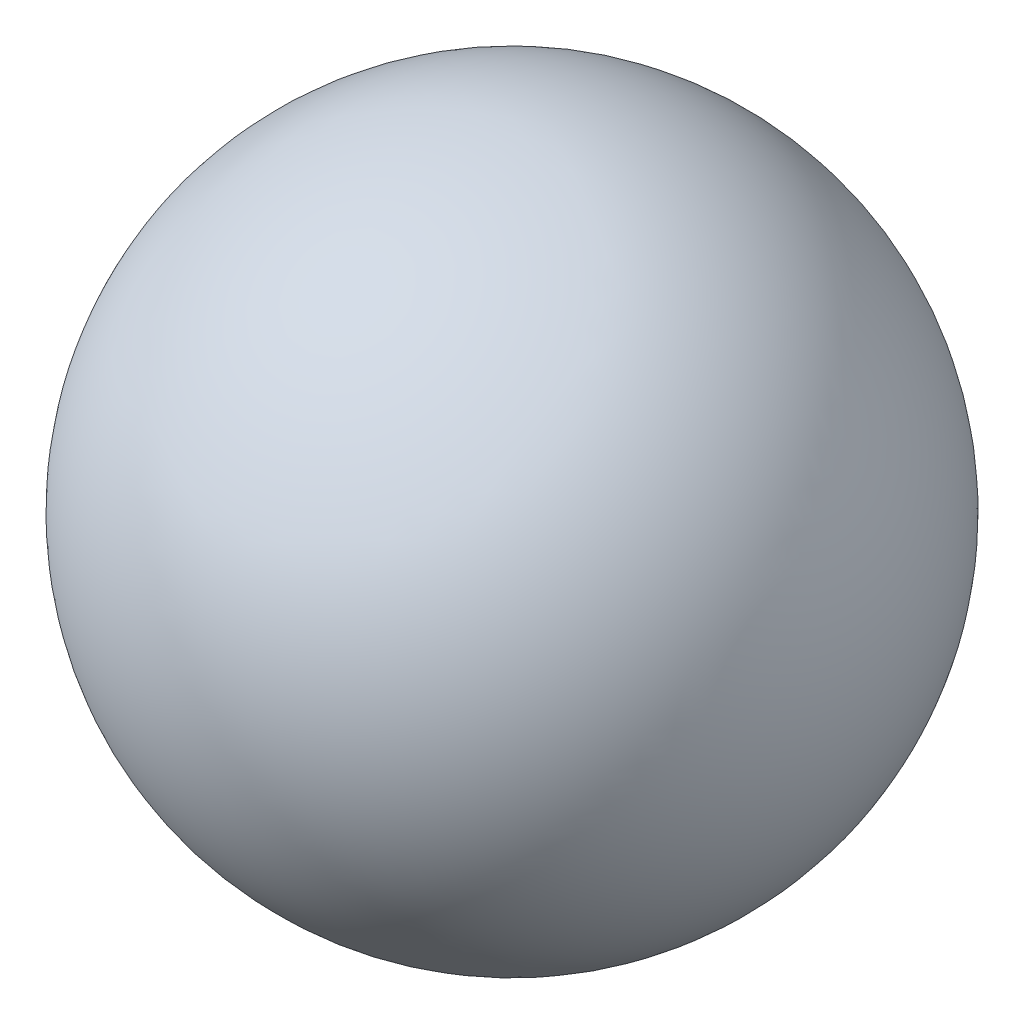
from build123d import *


with BuildPart() as part:
    # Esquisse1 → Base-R_volution (revolve)
    with BuildSketch(Plane(origin=(0, 0, 0), x_dir=(1, 0, 0), z_dir=(0, 1, 0))):
        with BuildLine():
            Line((0.55, 1.6), (2.65, 1.6))
            ThreePointArc((2.65, 1.6), (1.6, 2.65), (0.55, 1.6))
        make_face()
    revolve(axis=Axis((-0.15, 0, -1.6), (1, 0, 0)))


solid = part.part
